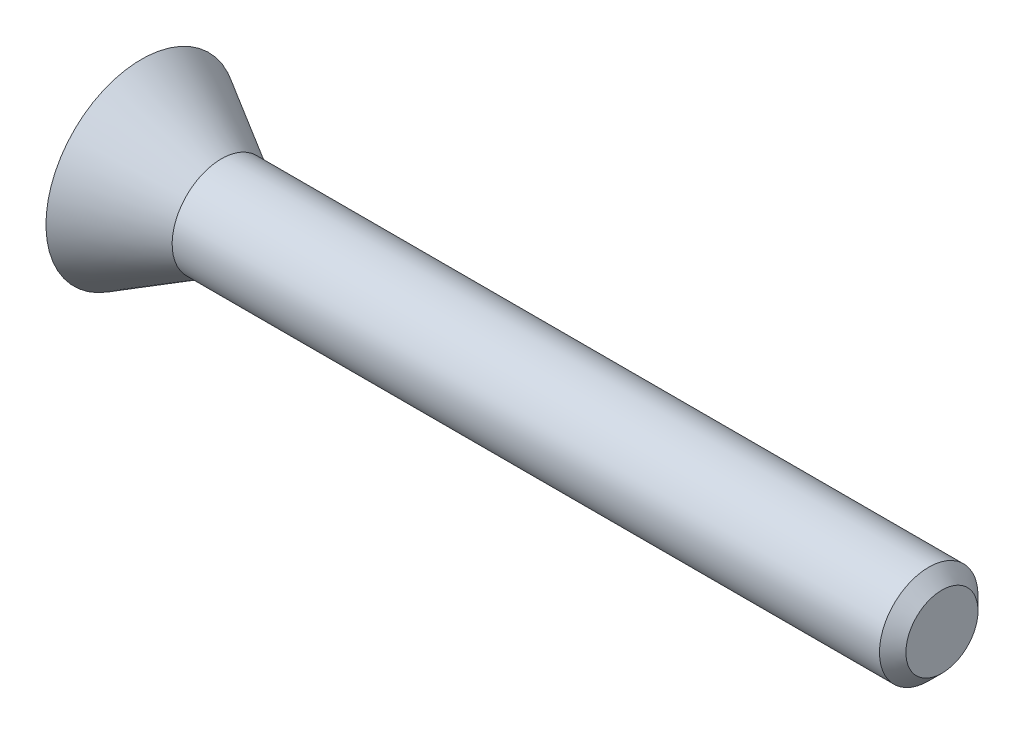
ISO-10303-21;
HEADER;
FILE_DESCRIPTION(('STEP AP214'),'2;1');
FILE_NAME('part.step','',(''),(''),'','','');
FILE_SCHEMA(('AUTOMOTIVE_DESIGN { 1 0 10303 214 1 1 1 1 }'));
ENDSEC;
DATA;
#1=APPLICATION_CONTEXT('core data for automotive mechanical design processes');
#2=APPLICATION_PROTOCOL_DEFINITION('international standard','automotive_design',2000,#1);
#3=PRODUCT_CONTEXT('',#1,'mechanical');
#4=PRODUCT('Part','Part','',(#3));
#5=PRODUCT_RELATED_PRODUCT_CATEGORY('part','',(#4));
#6=PRODUCT_DEFINITION_FORMATION('','',#4);
#7=PRODUCT_DEFINITION_CONTEXT('part definition',#1,'design');
#8=PRODUCT_DEFINITION('design','',#6,#7);
#9=PRODUCT_DEFINITION_SHAPE('','',#8);
#10=(LENGTH_UNIT() NAMED_UNIT(*) SI_UNIT(.MILLI.,.METRE.));
#11=(NAMED_UNIT(*) PLANE_ANGLE_UNIT() SI_UNIT($,.RADIAN.));
#12=(NAMED_UNIT(*) SI_UNIT($,.STERADIAN.) SOLID_ANGLE_UNIT());
#13=UNCERTAINTY_MEASURE_WITH_UNIT(LENGTH_MEASURE(1.E-05),#10,'distance_accuracy_value','');
#14=(GEOMETRIC_REPRESENTATION_CONTEXT(3) GLOBAL_UNCERTAINTY_ASSIGNED_CONTEXT((#13)) GLOBAL_UNIT_ASSIGNED_CONTEXT((#10,
#11,#12)) REPRESENTATION_CONTEXT('',''));
#15=CARTESIAN_POINT('',(0.,0.,0.));
#16=DIRECTION('',(0.,0.,1.));
#17=DIRECTION('',(1.,0.,0.));
#18=AXIS2_PLACEMENT_3D('',#15,#16,#17);
#19=CARTESIAN_POINT('',(-6.5,0.,0.));
#20=DIRECTION('',(1.,0.,0.));
#21=DIRECTION('',(0.,0.,-1.));
#22=AXIS2_PLACEMENT_3D('',#19,#20,#21);
#23=PLANE('',#22);
#24=DIRECTION('',(0.,-1.,0.));
#25=VECTOR('',#24,1.);
#26=CARTESIAN_POINT('',(-6.5,0.55,-1.0078776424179));
#27=LINE('',#26,#25);
#28=CARTESIAN_POINT('',(-6.5,0.55,-1.0078776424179));
#29=VERTEX_POINT('',#28);
#30=CARTESIAN_POINT('',(-6.5,0.386972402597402,-1.0078776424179));
#31=VERTEX_POINT('',#30);
#32=EDGE_CURVE('E298',#29,#31,#27,.T.);
#33=ORIENTED_EDGE('',*,*,#32,.F.);
#34=DIRECTION('',(0.,0.,-1.));
#35=VECTOR('',#34,1.);
#36=CARTESIAN_POINT('',(-6.5,0.55,-0.268186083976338));
#37=LINE('',#36,#35);
#38=CARTESIAN_POINT('',(-6.5,0.55,-0.268186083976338));
#39=VERTEX_POINT('',#38);
#40=EDGE_CURVE('E54',#39,#29,#37,.T.);
#41=ORIENTED_EDGE('',*,*,#40,.F.);
#42=DIRECTION('',(0.,1.,0.));
#43=VECTOR('',#42,1.);
#44=CARTESIAN_POINT('',(-6.5,0.111038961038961,-0.268186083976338));
#45=LINE('',#44,#43);
#46=CARTESIAN_POINT('',(-6.5,0.111038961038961,-0.268186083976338));
#47=VERTEX_POINT('',#46);
#48=EDGE_CURVE('E275',#47,#39,#45,.T.);
#49=ORIENTED_EDGE('',*,*,#48,.F.);
#50=DIRECTION('',(0.,0.,1.));
#51=VECTOR('',#50,1.);
#52=CARTESIAN_POINT('',(-6.5,0.111038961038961,-0.512199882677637));
#53=LINE('',#52,#51);
#54=CARTESIAN_POINT('',(-6.5,0.111038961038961,-0.512199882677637));
#55=VERTEX_POINT('',#54);
#56=EDGE_CURVE('E278',#55,#47,#53,.T.);
#57=ORIENTED_EDGE('',*,*,#56,.F.);
#58=DIRECTION('',(0.,-1.,0.));
#59=VECTOR('',#58,1.);
#60=CARTESIAN_POINT('',(-6.5,0.313636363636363,-0.512199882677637));
#61=LINE('',#60,#59);
#62=CARTESIAN_POINT('',(-6.5,0.313636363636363,-0.512199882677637));
#63=VERTEX_POINT('',#62);
#64=EDGE_CURVE('E312',#63,#55,#61,.T.);
#65=ORIENTED_EDGE('',*,*,#64,.F.);
#66=DIRECTION('',(0.,0.,1.));
#67=VECTOR('',#66,1.);
#68=CARTESIAN_POINT('',(-6.5,0.313636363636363,-0.734582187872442));
#69=LINE('',#68,#67);
#70=CARTESIAN_POINT('',(-6.5,0.313636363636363,-0.734582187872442));
#71=VERTEX_POINT('',#70);
#72=EDGE_CURVE('E309',#71,#63,#69,.T.);
#73=ORIENTED_EDGE('',*,*,#72,.F.);
#74=DIRECTION('',(0.,0.966781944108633,-0.255602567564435));
#75=VECTOR('',#74,1.);
#76=CARTESIAN_POINT('',(-6.5,-0.75,-0.453372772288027));
#77=LINE('',#76,#75);
#78=CARTESIAN_POINT('',(-6.5,-0.75,-0.453372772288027));
#79=VERTEX_POINT('',#78);
#80=EDGE_CURVE('E306',#79,#71,#77,.T.);
#81=ORIENTED_EDGE('',*,*,#80,.F.);
#82=DIRECTION('',(0.,0.,1.));
#83=VECTOR('',#82,1.);
#84=CARTESIAN_POINT('',(-6.5,-0.75,-0.717699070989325));
#85=LINE('',#84,#83);
#86=CARTESIAN_POINT('',(-6.5,-0.75,-0.717699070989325));
#87=VERTEX_POINT('',#86);
#88=EDGE_CURVE('E303',#87,#79,#85,.T.);
#89=ORIENTED_EDGE('',*,*,#88,.F.);
#90=DIRECTION('',(0.,-0.968940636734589,0.247293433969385));
#91=VECTOR('',#90,1.);
#92=CARTESIAN_POINT('',(-6.5,0.386972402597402,-1.0078776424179));
#93=LINE('',#92,#91);
#94=EDGE_CURVE('E300',#31,#87,#93,.T.);
#95=ORIENTED_EDGE('',*,*,#94,.F.);
#96=EDGE_LOOP('',(#33,#41,#49,#57,#65,#73,#81,#89,#95));
#97=FACE_BOUND('',#96,.T.);
#98=DIRECTION('',(0.,1.,0.));
#99=VECTOR('',#98,1.);
#100=CARTESIAN_POINT('',(-6.5,-0.75,1.02247544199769));
#101=LINE('',#100,#99);
#102=CARTESIAN_POINT('',(-6.5,-0.75,1.02247544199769));
#103=VERTEX_POINT('',#102);
#104=CARTESIAN_POINT('',(-6.5,-0.528936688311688,1.02247544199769));
#105=VERTEX_POINT('',#104);
#106=EDGE_CURVE('E427',#103,#105,#101,.T.);
#107=ORIENTED_EDGE('',*,*,#106,.F.);
#108=DIRECTION('',(0.,0.,1.));
#109=VECTOR('',#108,1.);
#110=CARTESIAN_POINT('',(-6.5,-0.75,0.256931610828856));
#111=LINE('',#110,#109);
#112=CARTESIAN_POINT('',(-6.5,-0.75,0.256931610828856));
#113=VERTEX_POINT('',#112);
#114=EDGE_CURVE('E62',#113,#103,#111,.T.);
#115=ORIENTED_EDGE('',*,*,#114,.F.);
#116=DIRECTION('',(0.,-1.,0.));
#117=VECTOR('',#116,1.);
#118=CARTESIAN_POINT('',(-6.5,-0.513636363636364,0.256931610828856));
#119=LINE('',#118,#117);
#120=CARTESIAN_POINT('',(-6.5,-0.513636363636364,0.256931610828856));
#121=VERTEX_POINT('',#120);
#122=EDGE_CURVE('E336',#121,#113,#119,.T.);
#123=ORIENTED_EDGE('',*,*,#122,.F.);
#124=DIRECTION('',(0.,0.,-1.));
#125=VECTOR('',#124,1.);
#126=CARTESIAN_POINT('',(-6.5,-0.513636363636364,0.699322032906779));
#127=LINE('',#126,#125);
#128=CARTESIAN_POINT('',(-6.5,-0.513636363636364,0.699322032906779));
#129=VERTEX_POINT('',#128);
#130=EDGE_CURVE('E535',#129,#121,#127,.T.);
#131=ORIENTED_EDGE('',*,*,#130,.F.);
#132=DIRECTION('',(0.,-0.786034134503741,0.618183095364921));
#133=VECTOR('',#132,1.);
#134=CARTESIAN_POINT('',(-6.5,-0.108441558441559,0.380653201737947));
#135=LINE('',#134,#133);
#136=CARTESIAN_POINT('',(-6.5,-0.108441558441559,0.380653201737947));
#137=VERTEX_POINT('',#136);
#138=EDGE_CURVE('E538',#137,#129,#135,.T.);
#139=ORIENTED_EDGE('',*,*,#138,.F.);
#140=CARTESIAN_POINT('',(-6.5,0.226055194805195,0.264054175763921));
#141=CARTESIAN_POINT('',(-6.5,0.211263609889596,0.264390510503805));
#142=CARTESIAN_POINT('',(-6.5,0.18165430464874,0.265063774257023));
#143=CARTESIAN_POINT('',(-6.5,0.137339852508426,0.271141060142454));
#144=CARTESIAN_POINT('',(-6.5,0.0932516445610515,0.280934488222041));
#145=CARTESIAN_POINT('',(-6.5,0.0496026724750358,0.29438432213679));
#146=CARTESIAN_POINT('',(-6.5,0.00714900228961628,0.311092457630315));
#147=CARTESIAN_POINT('',(-6.5,-0.0335279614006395,0.331145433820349));
#148=CARTESIAN_POINT('',(-6.5,-0.0724462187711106,0.353777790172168));
#149=CARTESIAN_POINT('',(-6.5,-0.0964660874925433,0.371711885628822));
#150=CARTESIAN_POINT('',(-6.5,-0.108441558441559,0.380653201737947));
#151=B_SPLINE_CURVE_WITH_KNOTS('',3,(#140,#141,#142,#143,#144,#145,#146,#147,#148,#149,#150),
.UNSPECIFIED.,.F.,.F.,(4,1,1,1,1,1,1,1,4),(0.,0.123046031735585,0.246309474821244,
0.371480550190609,0.498560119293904,0.626024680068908,0.750715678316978,0.875715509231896,1.),.UNSPECIFIED.);
#152=CARTESIAN_POINT('',(-6.5,0.226055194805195,0.264054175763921));
#153=VERTEX_POINT('',#152);
#154=EDGE_CURVE('E541',#153,#137,#151,.T.);
#155=ORIENTED_EDGE('',*,*,#154,.F.);
#156=DIRECTION('',(0.,-1.,0.));
#157=VECTOR('',#156,1.);
#158=CARTESIAN_POINT('',(-6.5,0.22711038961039,0.264054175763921));
#159=LINE('',#158,#157);
#160=CARTESIAN_POINT('',(-6.5,0.22711038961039,0.264054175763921));
#161=VERTEX_POINT('',#160);
#162=EDGE_CURVE('E546',#161,#153,#159,.T.);
#163=ORIENTED_EDGE('',*,*,#162,.F.);
#164=CARTESIAN_POINT('',(-6.5,0.566883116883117,0.646826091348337));
#165=CARTESIAN_POINT('',(-6.5,0.566673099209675,0.632041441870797));
#166=CARTESIAN_POINT('',(-6.5,0.566264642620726,0.603287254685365));
#167=CARTESIAN_POINT('',(-6.5,0.561855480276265,0.561426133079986));
#168=CARTESIAN_POINT('',(-6.5,0.555200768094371,0.522039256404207));
#169=CARTESIAN_POINT('',(-6.5,0.545465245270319,0.48519000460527));
#170=CARTESIAN_POINT('',(-6.5,0.532766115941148,0.451026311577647));
#171=CARTESIAN_POINT('',(-6.5,0.517454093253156,0.41944583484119));
#172=CARTESIAN_POINT('',(-6.5,0.499398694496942,0.390382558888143));
#173=CARTESIAN_POINT('',(-6.5,0.478561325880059,0.364059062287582));
#174=CARTESIAN_POINT('',(-6.5,0.455320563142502,0.340374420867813));
#175=CARTESIAN_POINT('',(-6.5,0.429440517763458,0.319988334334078));
#176=CARTESIAN_POINT('',(-6.5,0.401444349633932,0.302340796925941));
#177=CARTESIAN_POINT('',(-6.5,0.370789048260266,0.288545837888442));
#178=CARTESIAN_POINT('',(-6.5,0.338195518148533,0.277188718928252));
#179=CARTESIAN_POINT('',(-6.5,0.303079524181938,0.269835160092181));
#180=CARTESIAN_POINT('',(-6.5,0.265854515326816,0.264879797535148));
#181=CARTESIAN_POINT('',(-6.5,0.240229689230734,0.264333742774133));
#182=CARTESIAN_POINT('',(-6.5,0.22711038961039,0.264054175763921));
#183=B_SPLINE_CURVE_WITH_KNOTS('',3,(#164,#165,#166,#167,#168,#169,#170,#171,#172,#173,#174,
#175,#176,#177,#178,#179,#180,#181,#182),.UNSPECIFIED.,.F.,.F.,(4,1,1,1,1,1,1,1,1,1,1,1,1,1,1,1,
4),(0.,0.076231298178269,0.148259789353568,0.216860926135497,0.282100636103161,
0.344528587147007,0.404571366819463,0.462840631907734,0.520642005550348,0.577409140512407,
0.633580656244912,0.690215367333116,0.747647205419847,0.806597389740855,0.867894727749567,
0.932365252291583,1.),.UNSPECIFIED.);
#184=CARTESIAN_POINT('',(-6.5,0.566883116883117,0.646826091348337));
#185=VERTEX_POINT('',#184);
#186=EDGE_CURVE('E552',#185,#161,#183,.T.);
#187=ORIENTED_EDGE('',*,*,#186,.F.);
#188=CARTESIAN_POINT('',(-6.5,0.176724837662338,1.03856716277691));
#189=CARTESIAN_POINT('',(-6.5,0.19179366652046,1.0373331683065));
#190=CARTESIAN_POINT('',(-6.5,0.221207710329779,1.03492443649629));
#191=CARTESIAN_POINT('',(-6.5,0.263756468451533,1.02702756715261));
#192=CARTESIAN_POINT('',(-6.5,0.303834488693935,1.01682117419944));
#193=CARTESIAN_POINT('',(-6.5,0.341433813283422,1.00383726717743));
#194=CARTESIAN_POINT('',(-6.5,0.376119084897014,0.987152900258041));
#195=CARTESIAN_POINT('',(-6.5,0.4086153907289,0.96840750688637));
#196=CARTESIAN_POINT('',(-6.5,0.437917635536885,0.945861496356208));
#197=CARTESIAN_POINT('',(-6.5,0.465006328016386,0.921181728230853));
#198=CARTESIAN_POINT('',(-6.5,0.488865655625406,0.893692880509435));
#199=CARTESIAN_POINT('',(-6.5,0.509912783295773,0.864382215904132));
#200=CARTESIAN_POINT('',(-6.5,0.527427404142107,0.832806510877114));
#201=CARTESIAN_POINT('',(-6.5,0.541956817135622,0.79944580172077));
#202=CARTESIAN_POINT('',(-6.5,0.552984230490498,0.763930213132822));
#203=CARTESIAN_POINT('',(-6.5,0.56124460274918,0.726723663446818));
#204=CARTESIAN_POINT('',(-6.5,0.566008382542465,0.687399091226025));
#205=CARTESIAN_POINT('',(-6.5,0.566587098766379,0.660556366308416));
#206=CARTESIAN_POINT('',(-6.5,0.566883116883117,0.646826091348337));
#207=B_SPLINE_CURVE_WITH_KNOTS('',3,(#188,#189,#190,#191,#192,#193,#194,#195,#196,#197,#198,
#199,#200,#201,#202,#203,#204,#205,#206),.UNSPECIFIED.,.F.,.F.,(4,1,1,1,1,1,1,1,1,1,1,1,1,1,1,1,
4),(0.,0.073326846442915,0.14313249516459,0.209679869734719,0.273918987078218,0.335762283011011,
0.396210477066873,0.45560885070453,0.514796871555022,0.573764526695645,0.631900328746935,
0.689592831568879,0.748648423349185,0.808163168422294,0.86976604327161,0.933384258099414,1.),.UNSPECIFIED.);
#208=CARTESIAN_POINT('',(-6.5,0.176724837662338,1.03856716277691));
#209=VERTEX_POINT('',#208);
#210=EDGE_CURVE('E557',#209,#185,#207,.T.);
#211=ORIENTED_EDGE('',*,*,#210,.F.);
#212=DIRECTION('',(0.,1.,0.));
#213=VECTOR('',#212,1.);
#214=CARTESIAN_POINT('',(-6.5,0.175933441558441,1.03856716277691));
#215=LINE('',#214,#213);
#216=CARTESIAN_POINT('',(-6.5,0.175933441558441,1.03856716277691));
#217=VERTEX_POINT('',#216);
#218=EDGE_CURVE('E565',#217,#209,#215,.T.);
#219=ORIENTED_EDGE('',*,*,#218,.F.);
#220=DIRECTION('',(0.,0.,1.));
#221=VECTOR('',#220,1.);
#222=CARTESIAN_POINT('',(-6.5,0.175933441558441,0.788485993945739));
#223=LINE('',#222,#221);
#224=CARTESIAN_POINT('',(-6.5,0.175933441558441,0.788485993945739));
#225=VERTEX_POINT('',#224);
#226=EDGE_CURVE('E571',#225,#217,#223,.T.);
#227=ORIENTED_EDGE('',*,*,#226,.F.);
#228=DIRECTION('',(0.,-1.,0.));
#229=VECTOR('',#228,1.);
#230=CARTESIAN_POINT('',(-6.5,0.176724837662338,0.788485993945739));
#231=LINE('',#230,#229);
#232=CARTESIAN_POINT('',(-6.5,0.176724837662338,0.788485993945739));
#233=VERTEX_POINT('',#232);
#234=EDGE_CURVE('E574',#233,#225,#231,.T.);
#235=ORIENTED_EDGE('',*,*,#234,.F.);
#236=CARTESIAN_POINT('',(-6.5,0.33051948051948,0.644979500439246));
#237=CARTESIAN_POINT('',(-6.5,0.330146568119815,0.654536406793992));
#238=CARTESIAN_POINT('',(-6.5,0.329421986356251,0.673105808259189));
#239=CARTESIAN_POINT('',(-6.5,0.321391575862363,0.699393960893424));
#240=CARTESIAN_POINT('',(-6.5,0.308795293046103,0.723082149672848));
#241=CARTESIAN_POINT('',(-6.5,0.290821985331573,0.743503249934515));
#242=CARTESIAN_POINT('',(-6.5,0.268255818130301,0.76041346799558));
#243=CARTESIAN_POINT('',(-6.5,0.241682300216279,0.774137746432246));
#244=CARTESIAN_POINT('',(-6.5,0.21062165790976,0.783459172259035));
#245=CARTESIAN_POINT('',(-6.5,0.18838734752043,0.786756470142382));
#246=CARTESIAN_POINT('',(-6.5,0.176724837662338,0.788485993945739));
#247=B_SPLINE_CURVE_WITH_KNOTS('',3,(#236,#237,#238,#239,#240,#241,#242,#243,#244,#245,#246),
.UNSPECIFIED.,.F.,.F.,(4,1,1,1,1,1,1,1,4),(0.,0.122603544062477,0.238222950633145,
0.350089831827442,0.465559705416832,0.58502806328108,0.711014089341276,0.848418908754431,1.),.UNSPECIFIED.);
#248=CARTESIAN_POINT('',(-6.5,0.33051948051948,0.644979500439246));
#249=VERTEX_POINT('',#248);
#250=EDGE_CURVE('E577',#249,#233,#247,.T.);
#251=ORIENTED_EDGE('',*,*,#250,.F.);
#252=CARTESIAN_POINT('',(-6.5,0.220251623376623,0.515190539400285));
#253=CARTESIAN_POINT('',(-6.5,0.228563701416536,0.515550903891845));
#254=CARTESIAN_POINT('',(-6.5,0.24448831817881,0.516241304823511));
#255=CARTESIAN_POINT('',(-6.5,0.266926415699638,0.522745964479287));
#256=CARTESIAN_POINT('',(-6.5,0.286466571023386,0.533406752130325));
#257=CARTESIAN_POINT('',(-6.5,0.302606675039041,0.548675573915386));
#258=CARTESIAN_POINT('',(-6.5,0.31537252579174,0.567684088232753));
#259=CARTESIAN_POINT('',(-6.5,0.324369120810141,0.590428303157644));
#260=CARTESIAN_POINT('',(-6.5,0.329528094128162,0.616610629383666));
#261=CARTESIAN_POINT('',(-6.5,0.330177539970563,0.635194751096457));
#262=CARTESIAN_POINT('',(-6.5,0.33051948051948,0.644979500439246));
#263=B_SPLINE_CURVE_WITH_KNOTS('',3,(#252,#253,#254,#255,#256,#257,#258,#259,#260,#261,#262),
.UNSPECIFIED.,.F.,.F.,(4,1,1,1,1,1,1,1,4),(0.,0.128749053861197,0.246662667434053,
0.359069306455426,0.471077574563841,0.588039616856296,0.711712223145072,0.848213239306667,1.),.UNSPECIFIED.);
#264=CARTESIAN_POINT('',(-6.5,0.220251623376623,0.515190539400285));
#265=VERTEX_POINT('',#264);
#266=EDGE_CURVE('E582',#265,#249,#263,.T.);
#267=ORIENTED_EDGE('',*,*,#266,.F.);
#268=DIRECTION('',(0.,1.,0.));
#269=VECTOR('',#268,1.);
#270=CARTESIAN_POINT('',(-6.5,0.218405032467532,0.515190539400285));
#271=LINE('',#270,#269);
#272=CARTESIAN_POINT('',(-6.5,0.218405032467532,0.515190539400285));
#273=VERTEX_POINT('',#272);
#274=EDGE_CURVE('E590',#273,#265,#271,.T.);
#275=ORIENTED_EDGE('',*,*,#274,.F.);
#276=CARTESIAN_POINT('',(-6.5,0.0595982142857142,0.578238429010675));
#277=CARTESIAN_POINT('',(-6.5,0.0727089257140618,0.568933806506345));
#278=CARTESIAN_POINT('',(-6.5,0.0982547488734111,0.550804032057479));
#279=CARTESIAN_POINT('',(-6.5,0.13333675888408,0.534395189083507));
#280=CARTESIAN_POINT('',(-6.5,0.160841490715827,0.524173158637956));
#281=CARTESIAN_POINT('',(-6.5,0.180787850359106,0.519301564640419));
#282=CARTESIAN_POINT('',(-6.5,0.199818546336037,0.515826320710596));
#283=CARTESIAN_POINT('',(-6.5,0.21232326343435,0.515398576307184));
#284=CARTESIAN_POINT('',(-6.5,0.218405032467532,0.515190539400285));
#285=B_SPLINE_CURVE_WITH_KNOTS('',3,(#276,#277,#278,#279,#280,#281,#282,#283,#284),
.UNSPECIFIED.,.F.,.F.,(4,1,1,1,1,1,4),(0.,0.27737542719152,0.540457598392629,0.666416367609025,
0.784009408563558,0.894951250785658,1.),.UNSPECIFIED.);
#286=CARTESIAN_POINT('',(-6.5,0.0595982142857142,0.578238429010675));
#287=VERTEX_POINT('',#286);
#288=EDGE_CURVE('E596',#287,#273,#285,.T.);
#289=ORIENTED_EDGE('',*,*,#288,.F.);
#290=DIRECTION('',(0.,0.798150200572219,-0.602458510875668));
#291=VECTOR('',#290,1.);
#292=CARTESIAN_POINT('',(-6.5,-0.528936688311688,1.02247544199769));
#293=LINE('',#292,#291);
#294=EDGE_CURVE('E601',#105,#287,#293,.T.);
#295=ORIENTED_EDGE('',*,*,#294,.F.);
#296=EDGE_LOOP('',(#107,#115,#123,#131,#139,#155,#163,#187,#211,#219,#227,#235,#251,#267,#275,
#289,#295));
#297=FACE_BOUND('',#296,.T.);
#298=DIRECTION('',(0.,1.,0.));
#299=VECTOR('',#298,1.);
#300=CARTESIAN_POINT('',(-6.5,0.68,0.155));
#301=LINE('',#300,#299);
#302=CARTESIAN_POINT('',(-6.5,-1.025,0.155));
#303=VERTEX_POINT('',#302);
#304=CARTESIAN_POINT('',(-6.5,0.68,0.155));
#305=VERTEX_POINT('',#304);
#306=EDGE_CURVE('E433',#303,#305,#301,.T.);
#307=ORIENTED_EDGE('',*,*,#306,.F.);
#308=CARTESIAN_POINT('',(-6.5,-1.025,0.));
#309=DIRECTION('',(-1.,0.,0.));
#310=DIRECTION('',(0.,0.,1.));
#311=AXIS2_PLACEMENT_3D('',#308,#309,#310);
#312=CIRCLE('',#311,0.155);
#313=CARTESIAN_POINT('',(-6.5,-1.025,-0.155));
#314=VERTEX_POINT('',#313);
#315=EDGE_CURVE('E477',#314,#303,#312,.T.);
#316=ORIENTED_EDGE('',*,*,#315,.F.);
#317=DIRECTION('',(0.,-1.,0.));
#318=VECTOR('',#317,1.);
#319=CARTESIAN_POINT('',(-6.5,0.68,-0.155));
#320=LINE('',#319,#318);
#321=CARTESIAN_POINT('',(-6.5,0.68,-0.155));
#322=VERTEX_POINT('',#321);
#323=EDGE_CURVE('E460',#322,#314,#320,.T.);
#324=ORIENTED_EDGE('',*,*,#323,.F.);
#325=DIRECTION('',(0.,0.,1.));
#326=VECTOR('',#325,1.);
#327=CARTESIAN_POINT('',(-6.5,0.68,-0.37));
#328=LINE('',#327,#326);
#329=CARTESIAN_POINT('',(-6.5,0.68,-0.37));
#330=VERTEX_POINT('',#329);
#331=EDGE_CURVE('E464',#330,#322,#328,.T.);
#332=ORIENTED_EDGE('',*,*,#331,.F.);
#333=DIRECTION('',(0.,-0.858712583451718,-0.512457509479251));
#334=VECTOR('',#333,1.);
#335=CARTESIAN_POINT('',(-6.5,1.3,0.));
#336=LINE('',#335,#334);
#337=CARTESIAN_POINT('',(-6.5,1.3,0.));
#338=VERTEX_POINT('',#337);
#339=EDGE_CURVE('E467',#338,#330,#336,.T.);
#340=ORIENTED_EDGE('',*,*,#339,.F.);
#341=DIRECTION('',(0.,0.858712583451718,-0.512457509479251));
#342=VECTOR('',#341,1.);
#343=CARTESIAN_POINT('',(-6.5,1.3,0.));
#344=LINE('',#343,#342);
#345=CARTESIAN_POINT('',(-6.5,0.68,0.37));
#346=VERTEX_POINT('',#345);
#347=EDGE_CURVE('E470',#346,#338,#344,.T.);
#348=ORIENTED_EDGE('',*,*,#347,.F.);
#349=DIRECTION('',(0.,0.,1.));
#350=VECTOR('',#349,1.);
#351=CARTESIAN_POINT('',(-6.5,0.68,0.37));
#352=LINE('',#351,#350);
#353=EDGE_CURVE('E473',#305,#346,#352,.T.);
#354=ORIENTED_EDGE('',*,*,#353,.F.);
#355=EDGE_LOOP('',(#307,#316,#324,#332,#340,#348,#354));
#356=FACE_BOUND('',#355,.T.);
#357=CARTESIAN_POINT('',(-6.49999999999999,0.,0.));
#358=DIRECTION('',(-1.,0.,0.));
#359=DIRECTION('',(0.,-1.,0.));
#360=AXIS2_PLACEMENT_3D('',#357,#358,#359);
#361=CIRCLE('',#360,1.55);
#362=CARTESIAN_POINT('',(-6.49999999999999,-1.55,0.));
#363=VERTEX_POINT('',#362);
#364=EDGE_CURVE('E436',#363,#363,#361,.T.);
#365=ORIENTED_EDGE('',*,*,#364,.T.);
#366=EDGE_LOOP('',(#365));
#367=FACE_BOUND('',#366,.T.);
#368=ADVANCED_FACE('F39',(#97,#297,#356,#367),#23,.F.);
#369=CARTESIAN_POINT('',(-6.49999999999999,0.,0.));
#370=DIRECTION('',(-1.,0.,0.));
#371=DIRECTION('',(0.,-1.,0.));
#372=AXIS2_PLACEMENT_3D('',#369,#370,#371);
#373=CONICAL_SURFACE('',#372,1.55,0.523598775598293);
#374=CARTESIAN_POINT('',(-5.20096189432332,0.,0.));
#375=DIRECTION('',(-1.,0.,0.));
#376=DIRECTION('',(0.,-1.,0.));
#377=AXIS2_PLACEMENT_3D('',#374,#375,#376);
#378=CIRCLE('',#377,0.8);
#379=CARTESIAN_POINT('',(-5.20096189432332,-0.8,0.));
#380=VERTEX_POINT('',#379);
#381=EDGE_CURVE('E438',#380,#380,#378,.T.);
#382=ORIENTED_EDGE('',*,*,#381,.T.);
#383=EDGE_LOOP('',(#382));
#384=FACE_BOUND('',#383,.T.);
#385=ORIENTED_EDGE('',*,*,#364,.F.);
#386=EDGE_LOOP('',(#385));
#387=FACE_BOUND('',#386,.T.);
#388=ADVANCED_FACE('F410',(#384,#387),#373,.T.);
#389=CARTESIAN_POINT('',(-6.5,0.,0.));
#390=DIRECTION('',(-1.,0.,0.));
#391=DIRECTION('',(0.,-1.,0.));
#392=AXIS2_PLACEMENT_3D('',#389,#390,#391);
#393=CYLINDRICAL_SURFACE('',#392,0.8);
#394=CARTESIAN_POINT('',(6.2855,0.,0.));
#395=DIRECTION('',(1.,0.,0.));
#396=DIRECTION('',(0.,1.,0.));
#397=AXIS2_PLACEMENT_3D('',#394,#395,#396);
#398=CIRCLE('',#397,0.8);
#399=CARTESIAN_POINT('',(6.2855,0.8,0.));
#400=VERTEX_POINT('',#399);
#401=EDGE_CURVE('E47',#400,#400,#398,.F.);
#402=ORIENTED_EDGE('',*,*,#401,.T.);
#403=EDGE_LOOP('',(#402));
#404=FACE_BOUND('',#403,.T.);
#405=ORIENTED_EDGE('',*,*,#381,.F.);
#406=EDGE_LOOP('',(#405));
#407=FACE_BOUND('',#406,.T.);
#408=ADVANCED_FACE('F407',(#404,#407),#393,.T.);
#409=CARTESIAN_POINT('',(6.5,0.,0.));
#410=DIRECTION('',(1.,0.,0.));
#411=DIRECTION('',(0.,0.,-1.));
#412=AXIS2_PLACEMENT_3D('',#409,#410,#411);
#413=PLANE('',#412);
#414=CARTESIAN_POINT('',(6.5,0.,0.));
#415=DIRECTION('',(1.,0.,0.));
#416=DIRECTION('',(0.,0.,-1.));
#417=AXIS2_PLACEMENT_3D('',#414,#415,#416);
#418=CIRCLE('',#417,0.585500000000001);
#419=CARTESIAN_POINT('',(6.5,0.,-0.585500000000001));
#420=VERTEX_POINT('',#419);
#421=EDGE_CURVE('E11',#420,#420,#418,.T.);
#422=ORIENTED_EDGE('',*,*,#421,.T.);
#423=EDGE_LOOP('',(#422));
#424=FACE_BOUND('',#423,.T.);
#425=ADVANCED_FACE('F405',(#424),#413,.T.);
#426=CARTESIAN_POINT('',(-6.1,-1.025,0.));
#427=DIRECTION('',(-1.,0.,0.));
#428=DIRECTION('',(0.,0.,1.));
#429=AXIS2_PLACEMENT_3D('',#426,#427,#428);
#430=CYLINDRICAL_SURFACE('',#429,0.155);
#431=ORIENTED_EDGE('',*,*,#315,.T.);
#432=DIRECTION('',(-1.,0.,0.));
#433=VECTOR('',#432,1.);
#434=CARTESIAN_POINT('',(-6.1,-1.025,0.155));
#435=LINE('',#434,#433);
#436=CARTESIAN_POINT('',(-6.1,-1.025,0.155));
#437=VERTEX_POINT('',#436);
#438=EDGE_CURVE('E445',#437,#303,#435,.T.);
#439=ORIENTED_EDGE('',*,*,#438,.F.);
#440=CARTESIAN_POINT('',(-6.1,-1.025,0.));
#441=DIRECTION('',(-1.,0.,0.));
#442=DIRECTION('',(0.,0.,1.));
#443=AXIS2_PLACEMENT_3D('',#440,#441,#442);
#444=CIRCLE('',#443,0.155);
#445=CARTESIAN_POINT('',(-6.1,-1.025,-0.155));
#446=VERTEX_POINT('',#445);
#447=EDGE_CURVE('E463',#446,#437,#444,.T.);
#448=ORIENTED_EDGE('',*,*,#447,.F.);
#449=DIRECTION('',(-1.,0.,0.));
#450=VECTOR('',#449,1.);
#451=CARTESIAN_POINT('',(-6.1,-1.025,-0.155));
#452=LINE('',#451,#450);
#453=EDGE_CURVE('E442',#446,#314,#452,.T.);
#454=ORIENTED_EDGE('',*,*,#453,.T.);
#455=EDGE_LOOP('',(#431,#439,#448,#454));
#456=FACE_BOUND('',#455,.T.);
#457=ADVANCED_FACE('F383',(#456),#430,.F.);
#458=CARTESIAN_POINT('',(-6.1,0.68,-0.155));
#459=DIRECTION('',(0.,0.,-1.));
#460=DIRECTION('',(0.,1.,0.));
#461=AXIS2_PLACEMENT_3D('',#458,#459,#460);
#462=PLANE('',#461);
#463=ORIENTED_EDGE('',*,*,#323,.T.);
#464=ORIENTED_EDGE('',*,*,#453,.F.);
#465=DIRECTION('',(0.,-1.,0.));
#466=VECTOR('',#465,1.);
#467=CARTESIAN_POINT('',(-6.1,0.68,-0.155));
#468=LINE('',#467,#466);
#469=CARTESIAN_POINT('',(-6.1,0.68,-0.155));
#470=VERTEX_POINT('',#469);
#471=EDGE_CURVE('E449',#470,#446,#468,.T.);
#472=ORIENTED_EDGE('',*,*,#471,.F.);
#473=DIRECTION('',(-1.,0.,0.));
#474=VECTOR('',#473,1.);
#475=CARTESIAN_POINT('',(-6.1,0.68,-0.155));
#476=LINE('',#475,#474);
#477=EDGE_CURVE('E457',#470,#322,#476,.T.);
#478=ORIENTED_EDGE('',*,*,#477,.T.);
#479=EDGE_LOOP('',(#463,#464,#472,#478));
#480=FACE_BOUND('',#479,.T.);
#481=ADVANCED_FACE('F379',(#480),#462,.F.);
#482=CARTESIAN_POINT('',(-6.1,0.68,-0.37));
#483=DIRECTION('',(0.,-1.,0.));
#484=DIRECTION('',(0.,0.,-1.));
#485=AXIS2_PLACEMENT_3D('',#482,#483,#484);
#486=PLANE('',#485);
#487=ORIENTED_EDGE('',*,*,#331,.T.);
#488=ORIENTED_EDGE('',*,*,#477,.F.);
#489=DIRECTION('',(0.,0.,1.));
#490=VECTOR('',#489,1.);
#491=CARTESIAN_POINT('',(-6.1,0.68,-0.37));
#492=LINE('',#491,#490);
#493=CARTESIAN_POINT('',(-6.1,0.68,-0.37));
#494=VERTEX_POINT('',#493);
#495=EDGE_CURVE('E482',#494,#470,#492,.T.);
#496=ORIENTED_EDGE('',*,*,#495,.F.);
#497=DIRECTION('',(-1.,0.,0.));
#498=VECTOR('',#497,1.);
#499=CARTESIAN_POINT('',(-6.1,0.68,-0.37));
#500=LINE('',#499,#498);
#501=EDGE_CURVE('E455',#494,#330,#500,.T.);
#502=ORIENTED_EDGE('',*,*,#501,.T.);
#503=EDGE_LOOP('',(#487,#488,#496,#502));
#504=FACE_BOUND('',#503,.T.);
#505=ADVANCED_FACE('F382',(#504),#486,.F.);
#506=CARTESIAN_POINT('',(-6.1,1.3,0.));
#507=DIRECTION('',(0.,0.512457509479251,-0.858712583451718));
#508=DIRECTION('',(0.,0.858712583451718,0.512457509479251));
#509=AXIS2_PLACEMENT_3D('',#506,#507,#508);
#510=PLANE('',#509);
#511=ORIENTED_EDGE('',*,*,#339,.T.);
#512=ORIENTED_EDGE('',*,*,#501,.F.);
#513=DIRECTION('',(0.,-0.858712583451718,-0.512457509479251));
#514=VECTOR('',#513,1.);
#515=CARTESIAN_POINT('',(-6.1,1.3,0.));
#516=LINE('',#515,#514);
#517=CARTESIAN_POINT('',(-6.1,1.3,0.));
#518=VERTEX_POINT('',#517);
#519=EDGE_CURVE('E485',#518,#494,#516,.T.);
#520=ORIENTED_EDGE('',*,*,#519,.F.);
#521=DIRECTION('',(-1.,0.,0.));
#522=VECTOR('',#521,1.);
#523=CARTESIAN_POINT('',(-6.1,1.3,0.));
#524=LINE('',#523,#522);
#525=EDGE_CURVE('E453',#518,#338,#524,.T.);
#526=ORIENTED_EDGE('',*,*,#525,.T.);
#527=EDGE_LOOP('',(#511,#512,#520,#526));
#528=FACE_BOUND('',#527,.T.);
#529=ADVANCED_FACE('F387',(#528),#510,.F.);
#530=CARTESIAN_POINT('',(-6.1,1.3,0.));
#531=DIRECTION('',(0.,0.512457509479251,0.858712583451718));
#532=DIRECTION('',(0.,-0.858712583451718,0.512457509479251));
#533=AXIS2_PLACEMENT_3D('',#530,#531,#532);
#534=PLANE('',#533);
#535=ORIENTED_EDGE('',*,*,#347,.T.);
#536=ORIENTED_EDGE('',*,*,#525,.F.);
#537=DIRECTION('',(0.,0.858712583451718,-0.512457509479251));
#538=VECTOR('',#537,1.);
#539=CARTESIAN_POINT('',(-6.1,1.3,0.));
#540=LINE('',#539,#538);
#541=CARTESIAN_POINT('',(-6.1,0.68,0.37));
#542=VERTEX_POINT('',#541);
#543=EDGE_CURVE('E488',#542,#518,#540,.T.);
#544=ORIENTED_EDGE('',*,*,#543,.F.);
#545=DIRECTION('',(-1.,0.,0.));
#546=VECTOR('',#545,1.);
#547=CARTESIAN_POINT('',(-6.1,0.68,0.37));
#548=LINE('',#547,#546);
#549=EDGE_CURVE('E451',#542,#346,#548,.T.);
#550=ORIENTED_EDGE('',*,*,#549,.T.);
#551=EDGE_LOOP('',(#535,#536,#544,#550));
#552=FACE_BOUND('',#551,.T.);
#553=ADVANCED_FACE('F391',(#552),#534,.F.);
#554=CARTESIAN_POINT('',(-6.1,0.68,0.37));
#555=DIRECTION('',(0.,-1.,0.));
#556=DIRECTION('',(0.,0.,-1.));
#557=AXIS2_PLACEMENT_3D('',#554,#555,#556);
#558=PLANE('',#557);
#559=ORIENTED_EDGE('',*,*,#353,.T.);
#560=ORIENTED_EDGE('',*,*,#549,.F.);
#561=DIRECTION('',(0.,0.,1.));
#562=VECTOR('',#561,1.);
#563=CARTESIAN_POINT('',(-6.1,0.68,0.37));
#564=LINE('',#563,#562);
#565=CARTESIAN_POINT('',(-6.1,0.68,0.155));
#566=VERTEX_POINT('',#565);
#567=EDGE_CURVE('E491',#566,#542,#564,.T.);
#568=ORIENTED_EDGE('',*,*,#567,.F.);
#569=DIRECTION('',(-1.,0.,0.));
#570=VECTOR('',#569,1.);
#571=CARTESIAN_POINT('',(-6.1,0.68,0.155));
#572=LINE('',#571,#570);
#573=EDGE_CURVE('E448',#566,#305,#572,.T.);
#574=ORIENTED_EDGE('',*,*,#573,.T.);
#575=EDGE_LOOP('',(#559,#560,#568,#574));
#576=FACE_BOUND('',#575,.T.);
#577=ADVANCED_FACE('F395',(#576),#558,.F.);
#578=CARTESIAN_POINT('',(-6.1,0.68,0.155));
#579=DIRECTION('',(0.,0.,1.));
#580=DIRECTION('',(0.,-1.,0.));
#581=AXIS2_PLACEMENT_3D('',#578,#579,#580);
#582=PLANE('',#581);
#583=ORIENTED_EDGE('',*,*,#306,.T.);
#584=ORIENTED_EDGE('',*,*,#573,.F.);
#585=DIRECTION('',(0.,1.,0.));
#586=VECTOR('',#585,1.);
#587=CARTESIAN_POINT('',(-6.1,0.68,0.155));
#588=LINE('',#587,#586);
#589=EDGE_CURVE('E494',#437,#566,#588,.T.);
#590=ORIENTED_EDGE('',*,*,#589,.F.);
#591=ORIENTED_EDGE('',*,*,#438,.T.);
#592=EDGE_LOOP('',(#583,#584,#590,#591));
#593=FACE_BOUND('',#592,.T.);
#594=ADVANCED_FACE('F377',(#593),#582,.F.);
#595=CARTESIAN_POINT('',(-6.1,-1.025,0.));
#596=DIRECTION('',(-1.,0.,0.));
#597=DIRECTION('',(0.,0.,1.));
#598=AXIS2_PLACEMENT_3D('',#595,#596,#597);
#599=PLANE('',#598);
#600=ORIENTED_EDGE('',*,*,#447,.T.);
#601=ORIENTED_EDGE('',*,*,#589,.T.);
#602=ORIENTED_EDGE('',*,*,#567,.T.);
#603=ORIENTED_EDGE('',*,*,#543,.T.);
#604=ORIENTED_EDGE('',*,*,#519,.T.);
#605=ORIENTED_EDGE('',*,*,#495,.T.);
#606=ORIENTED_EDGE('',*,*,#471,.T.);
#607=EDGE_LOOP('',(#600,#601,#602,#603,#604,#605,#606));
#608=FACE_BOUND('',#607,.T.);
#609=ADVANCED_FACE('F374',(#608),#599,.T.);
#610=CARTESIAN_POINT('',(6.2855,0.,0.));
#611=DIRECTION('',(-1.,0.,0.));
#612=DIRECTION('',(0.,-1.,0.));
#613=AXIS2_PLACEMENT_3D('',#610,#611,#612);
#614=CONICAL_SURFACE('',#613,0.8,0.785398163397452);
#615=ORIENTED_EDGE('',*,*,#421,.F.);
#616=EDGE_LOOP('',(#615));
#617=FACE_BOUND('',#616,.T.);
#618=ORIENTED_EDGE('',*,*,#401,.F.);
#619=EDGE_LOOP('',(#618));
#620=FACE_BOUND('',#619,.T.);
#621=ADVANCED_FACE('F41',(#617,#620),#614,.T.);
#622=CARTESIAN_POINT('',(-6.1,-0.75,0.256931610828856));
#623=DIRECTION('',(0.,-1.,0.));
#624=DIRECTION('',(0.,0.,-1.));
#625=AXIS2_PLACEMENT_3D('',#622,#623,#624);
#626=PLANE('',#625);
#627=ORIENTED_EDGE('',*,*,#114,.T.);
#628=DIRECTION('',(-1.,0.,0.));
#629=VECTOR('',#628,1.);
#630=CARTESIAN_POINT('',(-6.1,-0.75,1.02247544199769));
#631=LINE('',#630,#629);
#632=CARTESIAN_POINT('',(-6.1,-0.75,1.02247544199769));
#633=VERTEX_POINT('',#632);
#634=EDGE_CURVE('E499',#633,#103,#631,.T.);
#635=ORIENTED_EDGE('',*,*,#634,.F.);
#636=DIRECTION('',(0.,0.,1.));
#637=VECTOR('',#636,1.);
#638=CARTESIAN_POINT('',(-6.1,-0.75,0.256931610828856));
#639=LINE('',#638,#637);
#640=CARTESIAN_POINT('',(-6.1,-0.75,0.256931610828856));
#641=VERTEX_POINT('',#640);
#642=EDGE_CURVE('E332',#641,#633,#639,.T.);
#643=ORIENTED_EDGE('',*,*,#642,.F.);
#644=DIRECTION('',(-1.,0.,0.));
#645=VECTOR('',#644,1.);
#646=CARTESIAN_POINT('',(-6.1,-0.75,0.256931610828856));
#647=LINE('',#646,#645);
#648=EDGE_CURVE('E479',#641,#113,#647,.T.);
#649=ORIENTED_EDGE('',*,*,#648,.T.);
#650=EDGE_LOOP('',(#627,#635,#643,#649));
#651=FACE_BOUND('',#650,.T.);
#652=ADVANCED_FACE('F370',(#651),#626,.F.);
#653=CARTESIAN_POINT('',(-6.1,-0.513636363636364,0.256931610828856));
#654=DIRECTION('',(0.,0.,-1.));
#655=DIRECTION('',(-1.,0.,0.));
#656=AXIS2_PLACEMENT_3D('',#653,#654,#655);
#657=PLANE('',#656);
#658=ORIENTED_EDGE('',*,*,#122,.T.);
#659=ORIENTED_EDGE('',*,*,#648,.F.);
#660=DIRECTION('',(0.,-1.,0.));
#661=VECTOR('',#660,1.);
#662=CARTESIAN_POINT('',(-6.1,-0.513636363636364,0.256931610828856));
#663=LINE('',#662,#661);
#664=CARTESIAN_POINT('',(-6.1,-0.513636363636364,0.256931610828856));
#665=VERTEX_POINT('',#664);
#666=EDGE_CURVE('E502',#665,#641,#663,.T.);
#667=ORIENTED_EDGE('',*,*,#666,.F.);
#668=DIRECTION('',(-1.,0.,0.));
#669=VECTOR('',#668,1.);
#670=CARTESIAN_POINT('',(-6.1,-0.513636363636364,0.256931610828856));
#671=LINE('',#670,#669);
#672=EDGE_CURVE('E530',#665,#121,#671,.T.);
#673=ORIENTED_EDGE('',*,*,#672,.T.);
#674=EDGE_LOOP('',(#658,#659,#667,#673));
#675=FACE_BOUND('',#674,.T.);
#676=ADVANCED_FACE('F373',(#675),#657,.F.);
#677=CARTESIAN_POINT('',(-6.1,-0.513636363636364,0.699322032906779));
#678=DIRECTION('',(0.,1.,0.));
#679=DIRECTION('',(0.,0.,1.));
#680=AXIS2_PLACEMENT_3D('',#677,#678,#679);
#681=PLANE('',#680);
#682=ORIENTED_EDGE('',*,*,#130,.T.);
#683=ORIENTED_EDGE('',*,*,#672,.F.);
#684=DIRECTION('',(0.,0.,-1.));
#685=VECTOR('',#684,1.);
#686=CARTESIAN_POINT('',(-6.1,-0.513636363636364,0.699322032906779));
#687=LINE('',#686,#685);
#688=CARTESIAN_POINT('',(-6.1,-0.513636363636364,0.699322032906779));
#689=VERTEX_POINT('',#688);
#690=EDGE_CURVE('E611',#689,#665,#687,.T.);
#691=ORIENTED_EDGE('',*,*,#690,.F.);
#692=DIRECTION('',(-1.,0.,0.));
#693=VECTOR('',#692,1.);
#694=CARTESIAN_POINT('',(-6.1,-0.513636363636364,0.699322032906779));
#695=LINE('',#694,#693);
#696=EDGE_CURVE('E528',#689,#129,#695,.T.);
#697=ORIENTED_EDGE('',*,*,#696,.T.);
#698=EDGE_LOOP('',(#682,#683,#691,#697));
#699=FACE_BOUND('',#698,.T.);
#700=ADVANCED_FACE('F724',(#699),#681,.F.);
#701=CARTESIAN_POINT('',(-6.1,-0.108441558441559,0.380653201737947));
#702=DIRECTION('',(0.,-0.618183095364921,-0.786034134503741));
#703=DIRECTION('',(0.,0.786034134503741,-0.618183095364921));
#704=AXIS2_PLACEMENT_3D('',#701,#702,#703);
#705=PLANE('',#704);
#706=ORIENTED_EDGE('',*,*,#138,.T.);
#707=ORIENTED_EDGE('',*,*,#696,.F.);
#708=DIRECTION('',(0.,-0.786034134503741,0.618183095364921));
#709=VECTOR('',#708,1.);
#710=CARTESIAN_POINT('',(-6.1,-0.108441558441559,0.380653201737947));
#711=LINE('',#710,#709);
#712=CARTESIAN_POINT('',(-6.1,-0.108441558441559,0.380653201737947));
#713=VERTEX_POINT('',#712);
#714=EDGE_CURVE('E614',#713,#689,#711,.T.);
#715=ORIENTED_EDGE('',*,*,#714,.F.);
#716=DIRECTION('',(-1.,0.,0.));
#717=VECTOR('',#716,1.);
#718=CARTESIAN_POINT('',(-6.1,-0.108441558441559,0.380653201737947));
#719=LINE('',#718,#717);
#720=EDGE_CURVE('E526',#713,#137,#719,.T.);
#721=ORIENTED_EDGE('',*,*,#720,.T.);
#722=EDGE_LOOP('',(#706,#707,#715,#721));
#723=FACE_BOUND('',#722,.T.);
#724=ADVANCED_FACE('F634',(#723),#705,.F.);
#725=CARTESIAN_POINT('',(-6.1,0.226055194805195,0.264054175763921));
#726=CARTESIAN_POINT('',(-6.1,0.211263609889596,0.264390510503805));
#727=CARTESIAN_POINT('',(-6.1,0.18165430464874,0.265063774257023));
#728=CARTESIAN_POINT('',(-6.1,0.137339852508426,0.271141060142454));
#729=CARTESIAN_POINT('',(-6.1,0.0932516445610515,0.280934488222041));
#730=CARTESIAN_POINT('',(-6.1,0.0496026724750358,0.29438432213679));
#731=CARTESIAN_POINT('',(-6.1,0.00714900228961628,0.311092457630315));
#732=CARTESIAN_POINT('',(-6.1,-0.0335279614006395,0.331145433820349));
#733=CARTESIAN_POINT('',(-6.1,-0.0724462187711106,0.353777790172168));
#734=CARTESIAN_POINT('',(-6.1,-0.0964660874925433,0.371711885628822));
#735=CARTESIAN_POINT('',(-6.1,-0.108441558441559,0.380653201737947));
#736=B_SPLINE_CURVE_WITH_KNOTS('',3,(#725,#726,#727,#728,#729,#730,#731,#732,#733,#734,#735),
.UNSPECIFIED.,.F.,.F.,(4,1,1,1,1,1,1,1,4),(0.,0.123046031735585,0.246309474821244,
0.371480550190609,0.498560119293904,0.626024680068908,0.750715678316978,0.875715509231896,1.),.UNSPECIFIED.);
#737=DIRECTION('',(-1.,0.,0.));
#738=VECTOR('',#737,1.);
#739=SURFACE_OF_LINEAR_EXTRUSION('',#736,#738);
#740=ORIENTED_EDGE('',*,*,#154,.T.);
#741=ORIENTED_EDGE('',*,*,#720,.F.);
#742=CARTESIAN_POINT('',(-6.1,0.226055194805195,0.264054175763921));
#743=VERTEX_POINT('',#742);
#744=EDGE_CURVE('E617',#743,#713,#736,.T.);
#745=ORIENTED_EDGE('',*,*,#744,.F.);
#746=DIRECTION('',(-1.,0.,0.));
#747=VECTOR('',#746,1.);
#748=CARTESIAN_POINT('',(-6.1,0.226055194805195,0.264054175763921));
#749=LINE('',#748,#747);
#750=EDGE_CURVE('E524',#743,#153,#749,.T.);
#751=ORIENTED_EDGE('',*,*,#750,.T.);
#752=EDGE_LOOP('',(#740,#741,#745,#751));
#753=FACE_BOUND('',#752,.T.);
#754=ADVANCED_FACE('F629',(#753),#739,.F.);
#755=CARTESIAN_POINT('',(-6.1,0.22711038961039,0.264054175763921));
#756=DIRECTION('',(0.,0.,-1.));
#757=DIRECTION('',(-1.,0.,0.));
#758=AXIS2_PLACEMENT_3D('',#755,#756,#757);
#759=PLANE('',#758);
#760=ORIENTED_EDGE('',*,*,#162,.T.);
#761=ORIENTED_EDGE('',*,*,#750,.F.);
#762=DIRECTION('',(0.,-1.,0.));
#763=VECTOR('',#762,1.);
#764=CARTESIAN_POINT('',(-6.1,0.22711038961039,0.264054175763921));
#765=LINE('',#764,#763);
#766=CARTESIAN_POINT('',(-6.1,0.22711038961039,0.264054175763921));
#767=VERTEX_POINT('',#766);
#768=EDGE_CURVE('E623',#767,#743,#765,.T.);
#769=ORIENTED_EDGE('',*,*,#768,.F.);
#770=DIRECTION('',(-1.,0.,0.));
#771=VECTOR('',#770,1.);
#772=CARTESIAN_POINT('',(-6.1,0.22711038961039,0.264054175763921));
#773=LINE('',#772,#771);
#774=EDGE_CURVE('E522',#767,#161,#773,.T.);
#775=ORIENTED_EDGE('',*,*,#774,.T.);
#776=EDGE_LOOP('',(#760,#761,#769,#775));
#777=FACE_BOUND('',#776,.T.);
#778=ADVANCED_FACE('F633',(#777),#759,.F.);
#779=CARTESIAN_POINT('',(-6.1,0.566883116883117,0.646826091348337));
#780=CARTESIAN_POINT('',(-6.1,0.566673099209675,0.632041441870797));
#781=CARTESIAN_POINT('',(-6.1,0.566264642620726,0.603287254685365));
#782=CARTESIAN_POINT('',(-6.1,0.561855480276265,0.561426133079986));
#783=CARTESIAN_POINT('',(-6.1,0.555200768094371,0.522039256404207));
#784=CARTESIAN_POINT('',(-6.1,0.545465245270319,0.48519000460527));
#785=CARTESIAN_POINT('',(-6.1,0.532766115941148,0.451026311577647));
#786=CARTESIAN_POINT('',(-6.1,0.517454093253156,0.41944583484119));
#787=CARTESIAN_POINT('',(-6.1,0.499398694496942,0.390382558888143));
#788=CARTESIAN_POINT('',(-6.1,0.478561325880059,0.364059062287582));
#789=CARTESIAN_POINT('',(-6.1,0.455320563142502,0.340374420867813));
#790=CARTESIAN_POINT('',(-6.1,0.429440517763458,0.319988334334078));
#791=CARTESIAN_POINT('',(-6.1,0.401444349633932,0.302340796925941));
#792=CARTESIAN_POINT('',(-6.1,0.370789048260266,0.288545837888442));
#793=CARTESIAN_POINT('',(-6.1,0.338195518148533,0.277188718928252));
#794=CARTESIAN_POINT('',(-6.1,0.303079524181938,0.269835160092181));
#795=CARTESIAN_POINT('',(-6.1,0.265854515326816,0.264879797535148));
#796=CARTESIAN_POINT('',(-6.1,0.240229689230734,0.264333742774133));
#797=CARTESIAN_POINT('',(-6.1,0.22711038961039,0.264054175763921));
#798=B_SPLINE_CURVE_WITH_KNOTS('',3,(#779,#780,#781,#782,#783,#784,#785,#786,#787,#788,#789,
#790,#791,#792,#793,#794,#795,#796,#797),.UNSPECIFIED.,.F.,.F.,(4,1,1,1,1,1,1,1,1,1,1,1,1,1,1,1,
4),(0.,0.076231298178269,0.148259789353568,0.216860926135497,0.282100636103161,
0.344528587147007,0.404571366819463,0.462840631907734,0.520642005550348,0.577409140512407,
0.633580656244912,0.690215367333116,0.747647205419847,0.806597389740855,0.867894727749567,
0.932365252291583,1.),.UNSPECIFIED.);
#799=DIRECTION('',(-1.,0.,0.));
#800=VECTOR('',#799,1.);
#801=SURFACE_OF_LINEAR_EXTRUSION('',#798,#800);
#802=ORIENTED_EDGE('',*,*,#186,.T.);
#803=ORIENTED_EDGE('',*,*,#774,.F.);
#804=CARTESIAN_POINT('',(-6.1,0.566883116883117,0.646826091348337));
#805=VERTEX_POINT('',#804);
#806=EDGE_CURVE('E647',#805,#767,#798,.T.);
#807=ORIENTED_EDGE('',*,*,#806,.F.);
#808=DIRECTION('',(-1.,0.,0.));
#809=VECTOR('',#808,1.);
#810=CARTESIAN_POINT('',(-6.1,0.566883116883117,0.646826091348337));
#811=LINE('',#810,#809);
#812=EDGE_CURVE('E520',#805,#185,#811,.T.);
#813=ORIENTED_EDGE('',*,*,#812,.T.);
#814=EDGE_LOOP('',(#802,#803,#807,#813));
#815=FACE_BOUND('',#814,.T.);
#816=ADVANCED_FACE('F639',(#815),#801,.F.);
#817=CARTESIAN_POINT('',(-6.1,0.176724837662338,1.03856716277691));
#818=CARTESIAN_POINT('',(-6.1,0.19179366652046,1.0373331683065));
#819=CARTESIAN_POINT('',(-6.1,0.221207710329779,1.03492443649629));
#820=CARTESIAN_POINT('',(-6.1,0.263756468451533,1.02702756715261));
#821=CARTESIAN_POINT('',(-6.1,0.303834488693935,1.01682117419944));
#822=CARTESIAN_POINT('',(-6.1,0.341433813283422,1.00383726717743));
#823=CARTESIAN_POINT('',(-6.1,0.376119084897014,0.987152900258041));
#824=CARTESIAN_POINT('',(-6.1,0.4086153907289,0.96840750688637));
#825=CARTESIAN_POINT('',(-6.1,0.437917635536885,0.945861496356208));
#826=CARTESIAN_POINT('',(-6.1,0.465006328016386,0.921181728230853));
#827=CARTESIAN_POINT('',(-6.1,0.488865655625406,0.893692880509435));
#828=CARTESIAN_POINT('',(-6.1,0.509912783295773,0.864382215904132));
#829=CARTESIAN_POINT('',(-6.1,0.527427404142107,0.832806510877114));
#830=CARTESIAN_POINT('',(-6.1,0.541956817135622,0.79944580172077));
#831=CARTESIAN_POINT('',(-6.1,0.552984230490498,0.763930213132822));
#832=CARTESIAN_POINT('',(-6.1,0.56124460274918,0.726723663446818));
#833=CARTESIAN_POINT('',(-6.1,0.566008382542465,0.687399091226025));
#834=CARTESIAN_POINT('',(-6.1,0.566587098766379,0.660556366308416));
#835=CARTESIAN_POINT('',(-6.1,0.566883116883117,0.646826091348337));
#836=B_SPLINE_CURVE_WITH_KNOTS('',3,(#817,#818,#819,#820,#821,#822,#823,#824,#825,#826,#827,
#828,#829,#830,#831,#832,#833,#834,#835),.UNSPECIFIED.,.F.,.F.,(4,1,1,1,1,1,1,1,1,1,1,1,1,1,1,1,
4),(0.,0.073326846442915,0.14313249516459,0.209679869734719,0.273918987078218,0.335762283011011,
0.396210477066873,0.45560885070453,0.514796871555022,0.573764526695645,0.631900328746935,
0.689592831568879,0.748648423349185,0.808163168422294,0.86976604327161,0.933384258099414,1.),.UNSPECIFIED.);
#837=DIRECTION('',(-1.,0.,0.));
#838=VECTOR('',#837,1.);
#839=SURFACE_OF_LINEAR_EXTRUSION('',#836,#838);
#840=ORIENTED_EDGE('',*,*,#210,.T.);
#841=ORIENTED_EDGE('',*,*,#812,.F.);
#842=CARTESIAN_POINT('',(-6.1,0.176724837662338,1.03856716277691));
#843=VERTEX_POINT('',#842);
#844=EDGE_CURVE('E652',#843,#805,#836,.T.);
#845=ORIENTED_EDGE('',*,*,#844,.F.);
#846=DIRECTION('',(-1.,0.,0.));
#847=VECTOR('',#846,1.);
#848=CARTESIAN_POINT('',(-6.1,0.176724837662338,1.03856716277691));
#849=LINE('',#848,#847);
#850=EDGE_CURVE('E518',#843,#209,#849,.T.);
#851=ORIENTED_EDGE('',*,*,#850,.T.);
#852=EDGE_LOOP('',(#840,#841,#845,#851));
#853=FACE_BOUND('',#852,.T.);
#854=ADVANCED_FACE('F643',(#853),#839,.F.);
#855=CARTESIAN_POINT('',(-6.1,0.175933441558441,1.03856716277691));
#856=DIRECTION('',(0.,0.,1.));
#857=DIRECTION('',(1.,0.,0.));
#858=AXIS2_PLACEMENT_3D('',#855,#856,#857);
#859=PLANE('',#858);
#860=ORIENTED_EDGE('',*,*,#218,.T.);
#861=ORIENTED_EDGE('',*,*,#850,.F.);
#862=DIRECTION('',(0.,1.,0.));
#863=VECTOR('',#862,1.);
#864=CARTESIAN_POINT('',(-6.1,0.175933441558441,1.03856716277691));
#865=LINE('',#864,#863);
#866=CARTESIAN_POINT('',(-6.1,0.175933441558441,1.03856716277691));
#867=VERTEX_POINT('',#866);
#868=EDGE_CURVE('E661',#867,#843,#865,.T.);
#869=ORIENTED_EDGE('',*,*,#868,.F.);
#870=DIRECTION('',(-1.,0.,0.));
#871=VECTOR('',#870,1.);
#872=CARTESIAN_POINT('',(-6.1,0.175933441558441,1.03856716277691));
#873=LINE('',#872,#871);
#874=EDGE_CURVE('E516',#867,#217,#873,.T.);
#875=ORIENTED_EDGE('',*,*,#874,.T.);
#876=EDGE_LOOP('',(#860,#861,#869,#875));
#877=FACE_BOUND('',#876,.T.);
#878=ADVANCED_FACE('F738',(#877),#859,.F.);
#879=CARTESIAN_POINT('',(-6.1,0.175933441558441,0.788485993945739));
#880=DIRECTION('',(0.,-1.,0.));
#881=DIRECTION('',(0.,0.,-1.));
#882=AXIS2_PLACEMENT_3D('',#879,#880,#881);
#883=PLANE('',#882);
#884=ORIENTED_EDGE('',*,*,#226,.T.);
#885=ORIENTED_EDGE('',*,*,#874,.F.);
#886=DIRECTION('',(0.,0.,1.));
#887=VECTOR('',#886,1.);
#888=CARTESIAN_POINT('',(-6.1,0.175933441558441,0.788485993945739));
#889=LINE('',#888,#887);
#890=CARTESIAN_POINT('',(-6.1,0.175933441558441,0.788485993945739));
#891=VERTEX_POINT('',#890);
#892=EDGE_CURVE('E667',#891,#867,#889,.T.);
#893=ORIENTED_EDGE('',*,*,#892,.F.);
#894=DIRECTION('',(-1.,0.,0.));
#895=VECTOR('',#894,1.);
#896=CARTESIAN_POINT('',(-6.1,0.175933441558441,0.788485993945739));
#897=LINE('',#896,#895);
#898=EDGE_CURVE('E514',#891,#225,#897,.T.);
#899=ORIENTED_EDGE('',*,*,#898,.T.);
#900=EDGE_LOOP('',(#884,#885,#893,#899));
#901=FACE_BOUND('',#900,.T.);
#902=ADVANCED_FACE('F742',(#901),#883,.F.);
#903=CARTESIAN_POINT('',(-6.1,0.176724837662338,0.788485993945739));
#904=DIRECTION('',(0.,0.,-1.));
#905=DIRECTION('',(-1.,0.,0.));
#906=AXIS2_PLACEMENT_3D('',#903,#904,#905);
#907=PLANE('',#906);
#908=ORIENTED_EDGE('',*,*,#234,.T.);
#909=ORIENTED_EDGE('',*,*,#898,.F.);
#910=DIRECTION('',(0.,-1.,0.));
#911=VECTOR('',#910,1.);
#912=CARTESIAN_POINT('',(-6.1,0.176724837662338,0.788485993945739));
#913=LINE('',#912,#911);
#914=CARTESIAN_POINT('',(-6.1,0.176724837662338,0.788485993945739));
#915=VERTEX_POINT('',#914);
#916=EDGE_CURVE('E670',#915,#891,#913,.T.);
#917=ORIENTED_EDGE('',*,*,#916,.F.);
#918=DIRECTION('',(-1.,0.,0.));
#919=VECTOR('',#918,1.);
#920=CARTESIAN_POINT('',(-6.1,0.176724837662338,0.788485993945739));
#921=LINE('',#920,#919);
#922=EDGE_CURVE('E512',#915,#233,#921,.T.);
#923=ORIENTED_EDGE('',*,*,#922,.T.);
#924=EDGE_LOOP('',(#908,#909,#917,#923));
#925=FACE_BOUND('',#924,.T.);
#926=ADVANCED_FACE('F690',(#925),#907,.F.);
#927=CARTESIAN_POINT('',(-6.1,0.33051948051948,0.644979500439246));
#928=CARTESIAN_POINT('',(-6.1,0.330146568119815,0.654536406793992));
#929=CARTESIAN_POINT('',(-6.1,0.329421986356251,0.673105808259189));
#930=CARTESIAN_POINT('',(-6.1,0.321391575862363,0.699393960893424));
#931=CARTESIAN_POINT('',(-6.1,0.308795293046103,0.723082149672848));
#932=CARTESIAN_POINT('',(-6.1,0.290821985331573,0.743503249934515));
#933=CARTESIAN_POINT('',(-6.1,0.268255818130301,0.76041346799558));
#934=CARTESIAN_POINT('',(-6.1,0.241682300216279,0.774137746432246));
#935=CARTESIAN_POINT('',(-6.1,0.21062165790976,0.783459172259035));
#936=CARTESIAN_POINT('',(-6.1,0.18838734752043,0.786756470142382));
#937=CARTESIAN_POINT('',(-6.1,0.176724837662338,0.788485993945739));
#938=B_SPLINE_CURVE_WITH_KNOTS('',3,(#927,#928,#929,#930,#931,#932,#933,#934,#935,#936,#937),
.UNSPECIFIED.,.F.,.F.,(4,1,1,1,1,1,1,1,4),(0.,0.122603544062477,0.238222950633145,
0.350089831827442,0.465559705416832,0.58502806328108,0.711014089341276,0.848418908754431,1.),.UNSPECIFIED.);
#939=DIRECTION('',(-1.,0.,0.));
#940=VECTOR('',#939,1.);
#941=SURFACE_OF_LINEAR_EXTRUSION('',#938,#940);
#942=ORIENTED_EDGE('',*,*,#250,.T.);
#943=ORIENTED_EDGE('',*,*,#922,.F.);
#944=CARTESIAN_POINT('',(-6.1,0.33051948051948,0.644979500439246));
#945=VERTEX_POINT('',#944);
#946=EDGE_CURVE('E673',#945,#915,#938,.T.);
#947=ORIENTED_EDGE('',*,*,#946,.F.);
#948=DIRECTION('',(-1.,0.,0.));
#949=VECTOR('',#948,1.);
#950=CARTESIAN_POINT('',(-6.1,0.33051948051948,0.644979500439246));
#951=LINE('',#950,#949);
#952=EDGE_CURVE('E510',#945,#249,#951,.T.);
#953=ORIENTED_EDGE('',*,*,#952,.T.);
#954=EDGE_LOOP('',(#942,#943,#947,#953));
#955=FACE_BOUND('',#954,.T.);
#956=ADVANCED_FACE('F686',(#955),#941,.F.);
#957=CARTESIAN_POINT('',(-6.1,0.220251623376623,0.515190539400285));
#958=CARTESIAN_POINT('',(-6.1,0.228563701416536,0.515550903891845));
#959=CARTESIAN_POINT('',(-6.1,0.24448831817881,0.516241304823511));
#960=CARTESIAN_POINT('',(-6.1,0.266926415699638,0.522745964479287));
#961=CARTESIAN_POINT('',(-6.1,0.286466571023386,0.533406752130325));
#962=CARTESIAN_POINT('',(-6.1,0.302606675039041,0.548675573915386));
#963=CARTESIAN_POINT('',(-6.1,0.31537252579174,0.567684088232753));
#964=CARTESIAN_POINT('',(-6.1,0.324369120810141,0.590428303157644));
#965=CARTESIAN_POINT('',(-6.1,0.329528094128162,0.616610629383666));
#966=CARTESIAN_POINT('',(-6.1,0.330177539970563,0.635194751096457));
#967=CARTESIAN_POINT('',(-6.1,0.33051948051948,0.644979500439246));
#968=B_SPLINE_CURVE_WITH_KNOTS('',3,(#957,#958,#959,#960,#961,#962,#963,#964,#965,#966,#967),
.UNSPECIFIED.,.F.,.F.,(4,1,1,1,1,1,1,1,4),(0.,0.128749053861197,0.246662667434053,
0.359069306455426,0.471077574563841,0.588039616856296,0.711712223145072,0.848213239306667,1.),.UNSPECIFIED.);
#969=DIRECTION('',(-1.,0.,0.));
#970=VECTOR('',#969,1.);
#971=SURFACE_OF_LINEAR_EXTRUSION('',#968,#970);
#972=ORIENTED_EDGE('',*,*,#266,.T.);
#973=ORIENTED_EDGE('',*,*,#952,.F.);
#974=CARTESIAN_POINT('',(-6.1,0.220251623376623,0.515190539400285));
#975=VERTEX_POINT('',#974);
#976=EDGE_CURVE('E678',#975,#945,#968,.T.);
#977=ORIENTED_EDGE('',*,*,#976,.F.);
#978=DIRECTION('',(-1.,0.,0.));
#979=VECTOR('',#978,1.);
#980=CARTESIAN_POINT('',(-6.1,0.220251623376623,0.515190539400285));
#981=LINE('',#980,#979);
#982=EDGE_CURVE('E508',#975,#265,#981,.T.);
#983=ORIENTED_EDGE('',*,*,#982,.T.);
#984=EDGE_LOOP('',(#972,#973,#977,#983));
#985=FACE_BOUND('',#984,.T.);
#986=ADVANCED_FACE('F689',(#985),#971,.F.);
#987=CARTESIAN_POINT('',(-6.1,0.218405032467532,0.515190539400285));
#988=DIRECTION('',(0.,0.,1.));
#989=DIRECTION('',(1.,0.,0.));
#990=AXIS2_PLACEMENT_3D('',#987,#988,#989);
#991=PLANE('',#990);
#992=ORIENTED_EDGE('',*,*,#274,.T.);
#993=ORIENTED_EDGE('',*,*,#982,.F.);
#994=DIRECTION('',(0.,1.,0.));
#995=VECTOR('',#994,1.);
#996=CARTESIAN_POINT('',(-6.1,0.218405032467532,0.515190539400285));
#997=LINE('',#996,#995);
#998=CARTESIAN_POINT('',(-6.1,0.218405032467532,0.515190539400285));
#999=VERTEX_POINT('',#998);
#1000=EDGE_CURVE('E348',#999,#975,#997,.T.);
#1001=ORIENTED_EDGE('',*,*,#1000,.F.);
#1002=DIRECTION('',(-1.,0.,0.));
#1003=VECTOR('',#1002,1.);
#1004=CARTESIAN_POINT('',(-6.1,0.218405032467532,0.515190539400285));
#1005=LINE('',#1004,#1003);
#1006=EDGE_CURVE('E506',#999,#273,#1005,.T.);
#1007=ORIENTED_EDGE('',*,*,#1006,.T.);
#1008=EDGE_LOOP('',(#992,#993,#1001,#1007));
#1009=FACE_BOUND('',#1008,.T.);
#1010=ADVANCED_FACE('F359',(#1009),#991,.F.);
#1011=CARTESIAN_POINT('',(-6.1,0.0595982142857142,0.578238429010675));
#1012=CARTESIAN_POINT('',(-6.1,0.0727089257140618,0.568933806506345));
#1013=CARTESIAN_POINT('',(-6.1,0.0982547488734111,0.550804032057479));
#1014=CARTESIAN_POINT('',(-6.1,0.13333675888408,0.534395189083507));
#1015=CARTESIAN_POINT('',(-6.1,0.160841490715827,0.524173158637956));
#1016=CARTESIAN_POINT('',(-6.1,0.180787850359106,0.519301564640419));
#1017=CARTESIAN_POINT('',(-6.1,0.199818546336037,0.515826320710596));
#1018=CARTESIAN_POINT('',(-6.1,0.21232326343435,0.515398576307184));
#1019=CARTESIAN_POINT('',(-6.1,0.218405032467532,0.515190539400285));
#1020=B_SPLINE_CURVE_WITH_KNOTS('',3,(#1011,#1012,#1013,#1014,#1015,#1016,#1017,#1018,#1019),
.UNSPECIFIED.,.F.,.F.,(4,1,1,1,1,1,4),(0.,0.27737542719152,0.540457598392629,0.666416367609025,
0.784009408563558,0.894951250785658,1.),.UNSPECIFIED.);
#1021=DIRECTION('',(-1.,0.,0.));
#1022=VECTOR('',#1021,1.);
#1023=SURFACE_OF_LINEAR_EXTRUSION('',#1020,#1022);
#1024=ORIENTED_EDGE('',*,*,#288,.T.);
#1025=ORIENTED_EDGE('',*,*,#1006,.F.);
#1026=CARTESIAN_POINT('',(-6.1,0.0595982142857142,0.578238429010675));
#1027=VERTEX_POINT('',#1026);
#1028=EDGE_CURVE('E342',#1027,#999,#1020,.T.);
#1029=ORIENTED_EDGE('',*,*,#1028,.F.);
#1030=DIRECTION('',(-1.,0.,0.));
#1031=VECTOR('',#1030,1.);
#1032=CARTESIAN_POINT('',(-6.1,0.0595982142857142,0.578238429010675));
#1033=LINE('',#1032,#1031);
#1034=EDGE_CURVE('E504',#1027,#287,#1033,.T.);
#1035=ORIENTED_EDGE('',*,*,#1034,.T.);
#1036=EDGE_LOOP('',(#1024,#1025,#1029,#1035));
#1037=FACE_BOUND('',#1036,.T.);
#1038=ADVANCED_FACE('F354',(#1037),#1023,.F.);
#1039=CARTESIAN_POINT('',(-6.1,-0.528936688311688,1.02247544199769));
#1040=DIRECTION('',(0.,0.602458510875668,0.798150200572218));
#1041=DIRECTION('',(0.,-0.798150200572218,0.602458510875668));
#1042=AXIS2_PLACEMENT_3D('',#1039,#1040,#1041);
#1043=PLANE('',#1042);
#1044=ORIENTED_EDGE('',*,*,#294,.T.);
#1045=ORIENTED_EDGE('',*,*,#1034,.F.);
#1046=DIRECTION('',(0.,0.798150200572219,-0.602458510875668));
#1047=VECTOR('',#1046,1.);
#1048=CARTESIAN_POINT('',(-6.1,-0.528936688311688,1.02247544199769));
#1049=LINE('',#1048,#1047);
#1050=CARTESIAN_POINT('',(-6.1,-0.528936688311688,1.02247544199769));
#1051=VERTEX_POINT('',#1050);
#1052=EDGE_CURVE('E339',#1051,#1027,#1049,.T.);
#1053=ORIENTED_EDGE('',*,*,#1052,.F.);
#1054=DIRECTION('',(-1.,0.,0.));
#1055=VECTOR('',#1054,1.);
#1056=CARTESIAN_POINT('',(-6.1,-0.528936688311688,1.02247544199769));
#1057=LINE('',#1056,#1055);
#1058=EDGE_CURVE('E501',#1051,#105,#1057,.T.);
#1059=ORIENTED_EDGE('',*,*,#1058,.T.);
#1060=EDGE_LOOP('',(#1044,#1045,#1053,#1059));
#1061=FACE_BOUND('',#1060,.T.);
#1062=ADVANCED_FACE('F358',(#1061),#1043,.F.);
#1063=CARTESIAN_POINT('',(-6.1,-0.75,1.02247544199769));
#1064=DIRECTION('',(0.,0.,1.));
#1065=DIRECTION('',(1.,0.,0.));
#1066=AXIS2_PLACEMENT_3D('',#1063,#1064,#1065);
#1067=PLANE('',#1066);
#1068=ORIENTED_EDGE('',*,*,#106,.T.);
#1069=ORIENTED_EDGE('',*,*,#1058,.F.);
#1070=DIRECTION('',(0.,1.,0.));
#1071=VECTOR('',#1070,1.);
#1072=CARTESIAN_POINT('',(-6.1,-0.75,1.02247544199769));
#1073=LINE('',#1072,#1071);
#1074=EDGE_CURVE('E335',#633,#1051,#1073,.T.);
#1075=ORIENTED_EDGE('',*,*,#1074,.F.);
#1076=ORIENTED_EDGE('',*,*,#634,.T.);
#1077=EDGE_LOOP('',(#1068,#1069,#1075,#1076));
#1078=FACE_BOUND('',#1077,.T.);
#1079=ADVANCED_FACE('F364',(#1078),#1067,.F.);
#1080=CARTESIAN_POINT('',(-6.1,0.134345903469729,0.53449083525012));
#1081=DIRECTION('',(-1.,0.,-1.02178065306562E-13));
#1082=DIRECTION('',(-1.02178065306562E-13,0.,1.));
#1083=AXIS2_PLACEMENT_3D('',#1080,#1081,#1082);
#1084=PLANE('',#1083);
#1085=ORIENTED_EDGE('',*,*,#642,.T.);
#1086=ORIENTED_EDGE('',*,*,#1074,.T.);
#1087=ORIENTED_EDGE('',*,*,#1052,.T.);
#1088=ORIENTED_EDGE('',*,*,#1028,.T.);
#1089=ORIENTED_EDGE('',*,*,#1000,.T.);
#1090=ORIENTED_EDGE('',*,*,#976,.T.);
#1091=ORIENTED_EDGE('',*,*,#946,.T.);
#1092=ORIENTED_EDGE('',*,*,#916,.T.);
#1093=ORIENTED_EDGE('',*,*,#892,.T.);
#1094=ORIENTED_EDGE('',*,*,#868,.T.);
#1095=ORIENTED_EDGE('',*,*,#844,.T.);
#1096=ORIENTED_EDGE('',*,*,#806,.T.);
#1097=ORIENTED_EDGE('',*,*,#768,.T.);
#1098=ORIENTED_EDGE('',*,*,#744,.T.);
#1099=ORIENTED_EDGE('',*,*,#714,.T.);
#1100=ORIENTED_EDGE('',*,*,#690,.T.);
#1101=ORIENTED_EDGE('',*,*,#666,.T.);
#1102=EDGE_LOOP('',(#1085,#1086,#1087,#1088,#1089,#1090,#1091,#1092,#1093,#1094,#1095,#1096,
#1097,#1098,#1099,#1100,#1101));
#1103=FACE_BOUND('',#1102,.T.);
#1104=ADVANCED_FACE('F368',(#1103),#1084,.T.);
#1105=CARTESIAN_POINT('',(-6.1,0.55,-0.268186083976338));
#1106=DIRECTION('',(0.,1.,0.));
#1107=DIRECTION('',(0.,0.,1.));
#1108=AXIS2_PLACEMENT_3D('',#1105,#1106,#1107);
#1109=PLANE('',#1108);
#1110=ORIENTED_EDGE('',*,*,#40,.T.);
#1111=DIRECTION('',(-1.,0.,0.));
#1112=VECTOR('',#1111,1.);
#1113=CARTESIAN_POINT('',(-6.1,0.55,-1.0078776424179));
#1114=LINE('',#1113,#1112);
#1115=CARTESIAN_POINT('',(-6.1,0.55,-1.0078776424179));
#1116=VERTEX_POINT('',#1115);
#1117=EDGE_CURVE('E252',#1116,#29,#1114,.T.);
#1118=ORIENTED_EDGE('',*,*,#1117,.F.);
#1119=DIRECTION('',(0.,0.,-1.));
#1120=VECTOR('',#1119,1.);
#1121=CARTESIAN_POINT('',(-6.1,0.55,-0.268186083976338));
#1122=LINE('',#1121,#1120);
#1123=CARTESIAN_POINT('',(-6.1,0.55,-0.268186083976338));
#1124=VERTEX_POINT('',#1123);
#1125=EDGE_CURVE('E256',#1124,#1116,#1122,.T.);
#1126=ORIENTED_EDGE('',*,*,#1125,.F.);
#1127=DIRECTION('',(-1.,0.,0.));
#1128=VECTOR('',#1127,1.);
#1129=CARTESIAN_POINT('',(-6.1,0.55,-0.268186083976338));
#1130=LINE('',#1129,#1128);
#1131=EDGE_CURVE('E317',#1124,#39,#1130,.T.);
#1132=ORIENTED_EDGE('',*,*,#1131,.T.);
#1133=EDGE_LOOP('',(#1110,#1118,#1126,#1132));
#1134=FACE_BOUND('',#1133,.T.);
#1135=ADVANCED_FACE('F254',(#1134),#1109,.F.);
#1136=CARTESIAN_POINT('',(-6.1,0.111038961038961,-0.268186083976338));
#1137=DIRECTION('',(0.,0.,1.));
#1138=DIRECTION('',(1.,0.,0.));
#1139=AXIS2_PLACEMENT_3D('',#1136,#1137,#1138);
#1140=PLANE('',#1139);
#1141=ORIENTED_EDGE('',*,*,#48,.T.);
#1142=ORIENTED_EDGE('',*,*,#1131,.F.);
#1143=DIRECTION('',(0.,1.,0.));
#1144=VECTOR('',#1143,1.);
#1145=CARTESIAN_POINT('',(-6.1,0.111038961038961,-0.268186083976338));
#1146=LINE('',#1145,#1144);
#1147=CARTESIAN_POINT('',(-6.1,0.111038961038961,-0.268186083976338));
#1148=VERTEX_POINT('',#1147);
#1149=EDGE_CURVE('E262',#1148,#1124,#1146,.T.);
#1150=ORIENTED_EDGE('',*,*,#1149,.F.);
#1151=DIRECTION('',(-1.,0.,0.));
#1152=VECTOR('',#1151,1.);
#1153=CARTESIAN_POINT('',(-6.1,0.111038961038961,-0.268186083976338));
#1154=LINE('',#1153,#1152);
#1155=EDGE_CURVE('E319',#1148,#47,#1154,.T.);
#1156=ORIENTED_EDGE('',*,*,#1155,.T.);
#1157=EDGE_LOOP('',(#1141,#1142,#1150,#1156));
#1158=FACE_BOUND('',#1157,.T.);
#1159=ADVANCED_FACE('F1000',(#1158),#1140,.F.);
#1160=CARTESIAN_POINT('',(-6.1,0.111038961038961,-0.512199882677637));
#1161=DIRECTION('',(0.,-1.,0.));
#1162=DIRECTION('',(0.,0.,-1.));
#1163=AXIS2_PLACEMENT_3D('',#1160,#1161,#1162);
#1164=PLANE('',#1163);
#1165=ORIENTED_EDGE('',*,*,#56,.T.);
#1166=ORIENTED_EDGE('',*,*,#1155,.F.);
#1167=DIRECTION('',(0.,0.,1.));
#1168=VECTOR('',#1167,1.);
#1169=CARTESIAN_POINT('',(-6.1,0.111038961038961,-0.512199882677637));
#1170=LINE('',#1169,#1168);
#1171=CARTESIAN_POINT('',(-6.1,0.111038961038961,-0.512199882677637));
#1172=VERTEX_POINT('',#1171);
#1173=EDGE_CURVE('E294',#1172,#1148,#1170,.T.);
#1174=ORIENTED_EDGE('',*,*,#1173,.F.);
#1175=DIRECTION('',(-1.,0.,0.));
#1176=VECTOR('',#1175,1.);
#1177=CARTESIAN_POINT('',(-6.1,0.111038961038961,-0.512199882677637));
#1178=LINE('',#1177,#1176);
#1179=EDGE_CURVE('E321',#1172,#55,#1178,.T.);
#1180=ORIENTED_EDGE('',*,*,#1179,.T.);
#1181=EDGE_LOOP('',(#1165,#1166,#1174,#1180));
#1182=FACE_BOUND('',#1181,.T.);
#1183=ADVANCED_FACE('F1010',(#1182),#1164,.F.);
#1184=CARTESIAN_POINT('',(-6.1,0.313636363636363,-0.512199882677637));
#1185=DIRECTION('',(0.,0.,-1.));
#1186=DIRECTION('',(-1.,0.,0.));
#1187=AXIS2_PLACEMENT_3D('',#1184,#1185,#1186);
#1188=PLANE('',#1187);
#1189=ORIENTED_EDGE('',*,*,#64,.T.);
#1190=ORIENTED_EDGE('',*,*,#1179,.F.);
#1191=DIRECTION('',(0.,-1.,0.));
#1192=VECTOR('',#1191,1.);
#1193=CARTESIAN_POINT('',(-6.1,0.313636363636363,-0.512199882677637));
#1194=LINE('',#1193,#1192);
#1195=CARTESIAN_POINT('',(-6.1,0.313636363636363,-0.512199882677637));
#1196=VERTEX_POINT('',#1195);
#1197=EDGE_CURVE('E291',#1196,#1172,#1194,.T.);
#1198=ORIENTED_EDGE('',*,*,#1197,.F.);
#1199=DIRECTION('',(-1.,0.,0.));
#1200=VECTOR('',#1199,1.);
#1201=CARTESIAN_POINT('',(-6.1,0.313636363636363,-0.512199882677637));
#1202=LINE('',#1201,#1200);
#1203=EDGE_CURVE('E323',#1196,#63,#1202,.T.);
#1204=ORIENTED_EDGE('',*,*,#1203,.T.);
#1205=EDGE_LOOP('',(#1189,#1190,#1198,#1204));
#1206=FACE_BOUND('',#1205,.T.);
#1207=ADVANCED_FACE('F1021',(#1206),#1188,.F.);
#1208=CARTESIAN_POINT('',(-6.1,0.313636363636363,-0.734582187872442));
#1209=DIRECTION('',(0.,-1.,0.));
#1210=DIRECTION('',(0.,0.,-1.));
#1211=AXIS2_PLACEMENT_3D('',#1208,#1209,#1210);
#1212=PLANE('',#1211);
#1213=ORIENTED_EDGE('',*,*,#72,.T.);
#1214=ORIENTED_EDGE('',*,*,#1203,.F.);
#1215=DIRECTION('',(0.,0.,1.));
#1216=VECTOR('',#1215,1.);
#1217=CARTESIAN_POINT('',(-6.1,0.313636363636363,-0.734582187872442));
#1218=LINE('',#1217,#1216);
#1219=CARTESIAN_POINT('',(-6.1,0.313636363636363,-0.734582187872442));
#1220=VERTEX_POINT('',#1219);
#1221=EDGE_CURVE('E288',#1220,#1196,#1218,.T.);
#1222=ORIENTED_EDGE('',*,*,#1221,.F.);
#1223=DIRECTION('',(-1.,0.,0.));
#1224=VECTOR('',#1223,1.);
#1225=CARTESIAN_POINT('',(-6.1,0.313636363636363,-0.734582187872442));
#1226=LINE('',#1225,#1224);
#1227=EDGE_CURVE('E325',#1220,#71,#1226,.T.);
#1228=ORIENTED_EDGE('',*,*,#1227,.T.);
#1229=EDGE_LOOP('',(#1213,#1214,#1222,#1228));
#1230=FACE_BOUND('',#1229,.T.);
#1231=ADVANCED_FACE('F1032',(#1230),#1212,.F.);
#1232=CARTESIAN_POINT('',(-6.1,-0.75,-0.453372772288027));
#1233=DIRECTION('',(0.,0.255602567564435,0.966781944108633));
#1234=DIRECTION('',(0.,-0.966781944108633,0.255602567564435));
#1235=AXIS2_PLACEMENT_3D('',#1232,#1233,#1234);
#1236=PLANE('',#1235);
#1237=ORIENTED_EDGE('',*,*,#80,.T.);
#1238=ORIENTED_EDGE('',*,*,#1227,.F.);
#1239=DIRECTION('',(0.,0.966781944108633,-0.255602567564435));
#1240=VECTOR('',#1239,1.);
#1241=CARTESIAN_POINT('',(-6.1,-0.75,-0.453372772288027));
#1242=LINE('',#1241,#1240);
#1243=CARTESIAN_POINT('',(-6.1,-0.75,-0.453372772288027));
#1244=VERTEX_POINT('',#1243);
#1245=EDGE_CURVE('E285',#1244,#1220,#1242,.T.);
#1246=ORIENTED_EDGE('',*,*,#1245,.F.);
#1247=DIRECTION('',(-1.,0.,0.));
#1248=VECTOR('',#1247,1.);
#1249=CARTESIAN_POINT('',(-6.1,-0.75,-0.453372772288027));
#1250=LINE('',#1249,#1248);
#1251=EDGE_CURVE('E327',#1244,#79,#1250,.T.);
#1252=ORIENTED_EDGE('',*,*,#1251,.T.);
#1253=EDGE_LOOP('',(#1237,#1238,#1246,#1252));
#1254=FACE_BOUND('',#1253,.T.);
#1255=ADVANCED_FACE('F1043',(#1254),#1236,.F.);
#1256=CARTESIAN_POINT('',(-6.1,-0.75,-0.717699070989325));
#1257=DIRECTION('',(0.,-1.,0.));
#1258=DIRECTION('',(0.,0.,-1.));
#1259=AXIS2_PLACEMENT_3D('',#1256,#1257,#1258);
#1260=PLANE('',#1259);
#1261=ORIENTED_EDGE('',*,*,#88,.T.);
#1262=ORIENTED_EDGE('',*,*,#1251,.F.);
#1263=DIRECTION('',(0.,0.,1.));
#1264=VECTOR('',#1263,1.);
#1265=CARTESIAN_POINT('',(-6.1,-0.75,-0.717699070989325));
#1266=LINE('',#1265,#1264);
#1267=CARTESIAN_POINT('',(-6.1,-0.75,-0.717699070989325));
#1268=VERTEX_POINT('',#1267);
#1269=EDGE_CURVE('E282',#1268,#1244,#1266,.T.);
#1270=ORIENTED_EDGE('',*,*,#1269,.F.);
#1271=DIRECTION('',(-1.,0.,0.));
#1272=VECTOR('',#1271,1.);
#1273=CARTESIAN_POINT('',(-6.1,-0.75,-0.717699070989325));
#1274=LINE('',#1273,#1272);
#1275=EDGE_CURVE('E329',#1268,#87,#1274,.T.);
#1276=ORIENTED_EDGE('',*,*,#1275,.T.);
#1277=EDGE_LOOP('',(#1261,#1262,#1270,#1276));
#1278=FACE_BOUND('',#1277,.T.);
#1279=ADVANCED_FACE('F1054',(#1278),#1260,.F.);
#1280=CARTESIAN_POINT('',(-6.1,0.386972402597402,-1.0078776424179));
#1281=DIRECTION('',(0.,-0.247293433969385,-0.968940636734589));
#1282=DIRECTION('',(0.,0.968940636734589,-0.247293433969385));
#1283=AXIS2_PLACEMENT_3D('',#1280,#1281,#1282);
#1284=PLANE('',#1283);
#1285=ORIENTED_EDGE('',*,*,#94,.T.);
#1286=ORIENTED_EDGE('',*,*,#1275,.F.);
#1287=DIRECTION('',(0.,-0.968940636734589,0.247293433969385));
#1288=VECTOR('',#1287,1.);
#1289=CARTESIAN_POINT('',(-6.1,0.386972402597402,-1.0078776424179));
#1290=LINE('',#1289,#1288);
#1291=CARTESIAN_POINT('',(-6.1,0.386972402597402,-1.0078776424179));
#1292=VERTEX_POINT('',#1291);
#1293=EDGE_CURVE('E270',#1292,#1268,#1290,.T.);
#1294=ORIENTED_EDGE('',*,*,#1293,.F.);
#1295=DIRECTION('',(-1.,0.,0.));
#1296=VECTOR('',#1295,1.);
#1297=CARTESIAN_POINT('',(-6.1,0.386972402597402,-1.0078776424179));
#1298=LINE('',#1297,#1296);
#1299=EDGE_CURVE('E261',#1292,#31,#1298,.T.);
#1300=ORIENTED_EDGE('',*,*,#1299,.T.);
#1301=EDGE_LOOP('',(#1285,#1286,#1294,#1300));
#1302=FACE_BOUND('',#1301,.T.);
#1303=ADVANCED_FACE('F1065',(#1302),#1284,.F.);
#1304=CARTESIAN_POINT('',(-6.1,0.55,-1.0078776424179));
#1305=DIRECTION('',(0.,0.,-1.));
#1306=DIRECTION('',(-1.,0.,0.));
#1307=AXIS2_PLACEMENT_3D('',#1304,#1305,#1306);
#1308=PLANE('',#1307);
#1309=ORIENTED_EDGE('',*,*,#32,.T.);
#1310=ORIENTED_EDGE('',*,*,#1299,.F.);
#1311=DIRECTION('',(0.,-1.,0.));
#1312=VECTOR('',#1311,1.);
#1313=CARTESIAN_POINT('',(-6.1,0.55,-1.0078776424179));
#1314=LINE('',#1313,#1312);
#1315=EDGE_CURVE('E265',#1116,#1292,#1314,.T.);
#1316=ORIENTED_EDGE('',*,*,#1315,.F.);
#1317=ORIENTED_EDGE('',*,*,#1117,.T.);
#1318=EDGE_LOOP('',(#1309,#1310,#1316,#1317));
#1319=FACE_BOUND('',#1318,.T.);
#1320=ADVANCED_FACE('F266',(#1319),#1308,.F.);
#1321=CARTESIAN_POINT('',(-6.1,0.,0.));
#1322=DIRECTION('',(-1.,0.,0.));
#1323=DIRECTION('',(0.,0.,1.));
#1324=AXIS2_PLACEMENT_3D('',#1321,#1322,#1323);
#1325=PLANE('',#1324);
#1326=ORIENTED_EDGE('',*,*,#1125,.T.);
#1327=ORIENTED_EDGE('',*,*,#1315,.T.);
#1328=ORIENTED_EDGE('',*,*,#1293,.T.);
#1329=ORIENTED_EDGE('',*,*,#1269,.T.);
#1330=ORIENTED_EDGE('',*,*,#1245,.T.);
#1331=ORIENTED_EDGE('',*,*,#1221,.T.);
#1332=ORIENTED_EDGE('',*,*,#1197,.T.);
#1333=ORIENTED_EDGE('',*,*,#1173,.T.);
#1334=ORIENTED_EDGE('',*,*,#1149,.T.);
#1335=EDGE_LOOP('',(#1326,#1327,#1328,#1329,#1330,#1331,#1332,#1333,#1334));
#1336=FACE_BOUND('',#1335,.T.);
#1337=ADVANCED_FACE('F272',(#1336),#1325,.T.);
#1338=CLOSED_SHELL('',(#368,#388,#408,#425,#457,#481,#505,#529,#553,#577,#594,#609,#621,#652,
#676,#700,#724,#754,#778,#816,#854,#878,#902,#926,#956,#986,#1010,#1038,#1062,#1079,#1104,#1135,
#1159,#1183,#1207,#1231,#1255,#1279,#1303,#1320,#1337));
#1339=MANIFOLD_SOLID_BREP('B2',#1338);
#1340=ADVANCED_BREP_SHAPE_REPRESENTATION('',(#18,#1339),#14);
#1341=SHAPE_DEFINITION_REPRESENTATION(#9,#1340);
ENDSEC;
END-ISO-10303-21;
